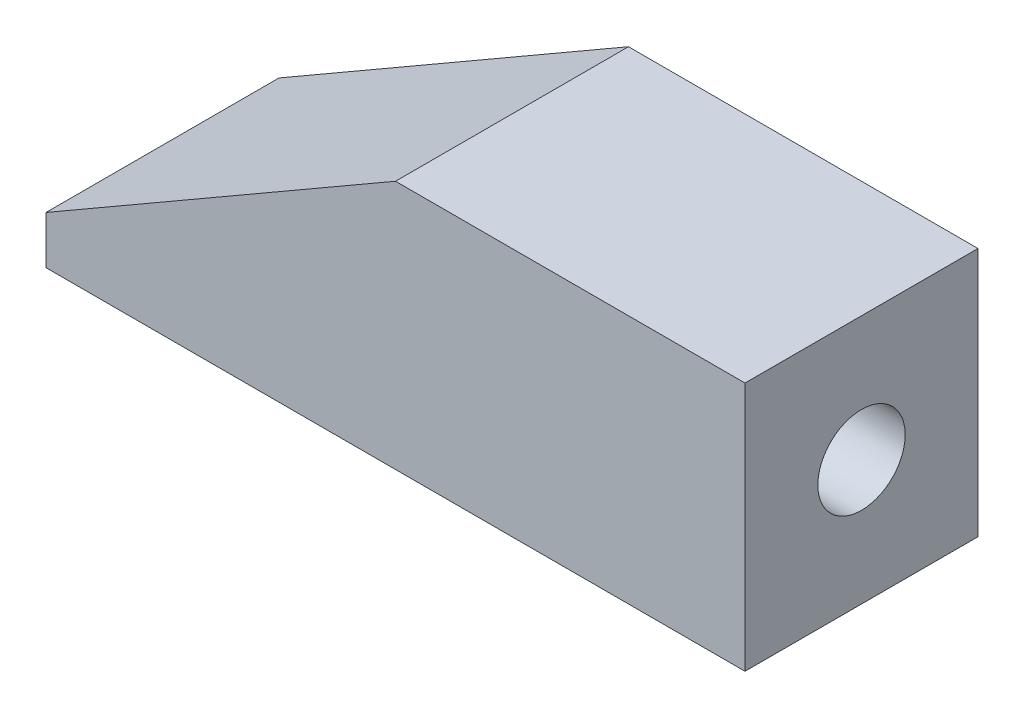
from build123d import *

# Parameters (mm, degrees)
BASE_EXTRUSION_DEPTH       = 28
TROU_TARAUD_M12X1_51_D     = 10.5
TROU_TARAUD_M12X1_51_DEPTH = 31.5
TROU_TARAUD_M12X1_51_TIP   = 3.15451825


with BuildPart() as part:
    # Esquisse1 → Base-Extrusion (new body)
    with BuildSketch(Plane.XY):
        Polygon((0, 5.751288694), (42, 30), (84, 30), (84, 0), (0, 0), align=None)
    extrude(amount=BASE_EXTRUSION_DEPTH)

    # Trou taraud_ M12x1.51
    with Locations(Plane(origin=(84, 0, 0), x_dir=(0, 0, -1), z_dir=(1, 0, 0))):
        with Locations((-14, 15)):
            Hole(TROU_TARAUD_M12X1_51_D / 2, depth=TROU_TARAUD_M12X1_51_DEPTH)
            with Locations((0, 0, -(TROU_TARAUD_M12X1_51_DEPTH + TROU_TARAUD_M12X1_51_TIP / 2))):  # 118° drill point
                Cone(0, TROU_TARAUD_M12X1_51_D / 2, TROU_TARAUD_M12X1_51_TIP, mode=Mode.SUBTRACT)


solid = part.part
